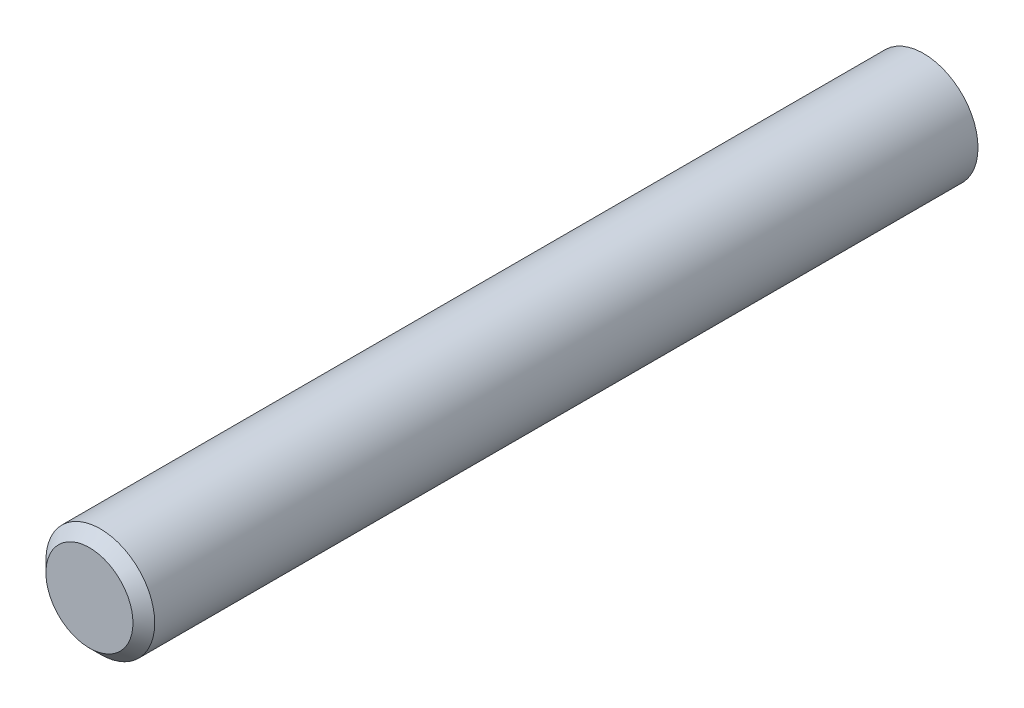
from build123d import *

# Parameters (mm, degrees)
ESQUISSE1_R               = 7.5
EXTRUSION1_DEPTH          = 115
TROU_TARAUD_M6X1_02_D     = 5
TROU_TARAUD_M6X1_02_DEPTH = 15
TROU_TARAUD_M6X1_02_TIP   = 1.502151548
CHANFREIN1_SIZE           = 1.5


with BuildPart() as part:
    # Esquisse1 → Extrusion1 (new body)
    with BuildSketch(Plane.XY):
        Circle(ESQUISSE1_R)
    extrude(amount=EXTRUSION1_DEPTH)

    # Trou taraud_ M6x1.02
    with Locations(Plane(origin=(0, 0, 0), x_dir=(-1, 0, 0), z_dir=(0, 0, -1))):
        with Locations((0, 0)):
            Hole(TROU_TARAUD_M6X1_02_D / 2, depth=TROU_TARAUD_M6X1_02_DEPTH)
            with Locations((0, 0, -(TROU_TARAUD_M6X1_02_DEPTH + TROU_TARAUD_M6X1_02_TIP / 2))):  # 118° drill point
                Cone(0, TROU_TARAUD_M6X1_02_D / 2, TROU_TARAUD_M6X1_02_TIP, mode=Mode.SUBTRACT)

    # Chanfrein1
    chanfrein1_edges = [part.edges().sort_by_distance(p)[0] for p in [
        (-7.5, 0, 115),
    ]]
    chamfer(chanfrein1_edges, length=CHANFREIN1_SIZE)


solid = part.part
